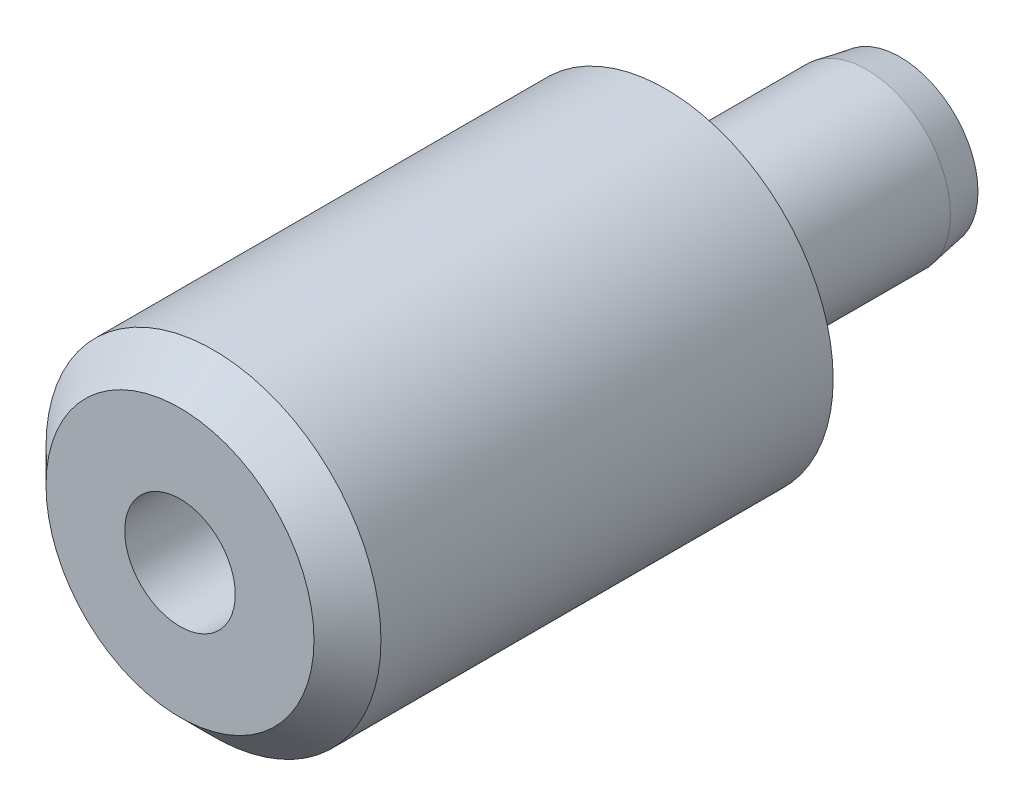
from build123d import *

# Parameters (mm, degrees)
SHOULDERFV_W                        = 5
SHOULDERFV_H                        = 14.5
M4X0_7_BOTTOMING_TAPPED_HOLE1_D     = 3.3
M4X0_7_BOTTOMING_TAPPED_HOLE1_DEPTH = 13
M4X0_7_BOTTOMING_TAPPED_HOLE1_TIP   = 0.991420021
FILLET1_R                           = 0.8
CHAMFER1_SIZE                       = 1


with BuildPart() as part:
    # ShoulderFV → Revolve1 (revolve)
    with BuildSketch(Plane(origin=(0, 0, 0), x_dir=(1, 0, 0), z_dir=(0, 1, 0))):
        with Locations((2.5, -7.75)):
            Rectangle(SHOULDERFV_W, SHOULDERFV_H)
    revolve(axis=Axis((0, 0, 0.5), (0, 0, -1)))

    # PinFV → Revolve2 (revolve)
    with BuildSketch(Plane(origin=(0, 0, 0), x_dir=(1, 0, 0), z_dir=(0, 1, 0))):
        Polygon((0, -0.5), (0, 6.5), (2.323673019, 6.5), (2.5, 5.5), (2.5, -0.5), align=None)
    revolve(axis=Axis((0, 0, -6.5), (0, 0, -1)))

    # M4x0.7 Bottoming Tapped Hole1
    with Locations(Plane.XY.offset(15)):
        with Locations((0, 0)):
            Hole(M4X0_7_BOTTOMING_TAPPED_HOLE1_D / 2, depth=M4X0_7_BOTTOMING_TAPPED_HOLE1_DEPTH)
            with Locations((0, 0, -(M4X0_7_BOTTOMING_TAPPED_HOLE1_DEPTH + M4X0_7_BOTTOMING_TAPPED_HOLE1_TIP / 2))):  # 118° drill point
                Cone(0, M4X0_7_BOTTOMING_TAPPED_HOLE1_D / 2, M4X0_7_BOTTOMING_TAPPED_HOLE1_TIP, mode=Mode.SUBTRACT)

    # Fillet1
    fillet1_edges = [part.edges().sort_by_distance(p)[0] for p in [
        (-2.5, 0, 0.5),
    ]]
    fillet(fillet1_edges, radius=FILLET1_R)

    # Chamfer1
    chamfer1_edges = [part.edges().sort_by_distance(p)[0] for p in [
        (-5, 0, 15),
    ]]
    chamfer(chamfer1_edges, length=CHAMFER1_SIZE)


solid = part.part
